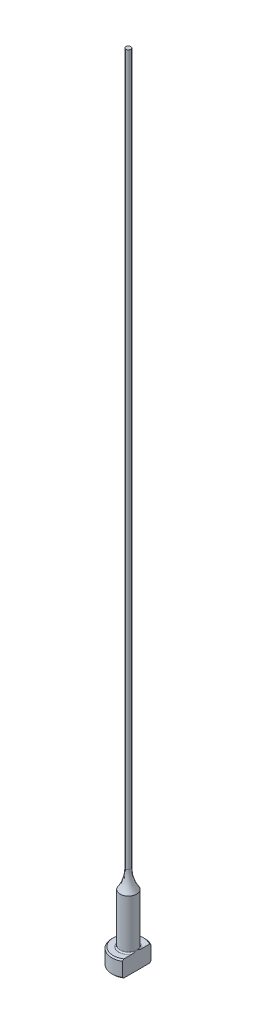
ISO-10303-21;
HEADER;
FILE_DESCRIPTION(('STEP AP214'),'2;1');
FILE_NAME('part.step','',(''),(''),'','','');
FILE_SCHEMA(('AUTOMOTIVE_DESIGN { 1 0 10303 214 1 1 1 1 }'));
ENDSEC;
DATA;
#1=APPLICATION_CONTEXT('core data for automotive mechanical design processes');
#2=APPLICATION_PROTOCOL_DEFINITION('international standard','automotive_design',2000,#1);
#3=PRODUCT_CONTEXT('',#1,'mechanical');
#4=PRODUCT('Part','Part','',(#3));
#5=PRODUCT_RELATED_PRODUCT_CATEGORY('part','',(#4));
#6=PRODUCT_DEFINITION_FORMATION('','',#4);
#7=PRODUCT_DEFINITION_CONTEXT('part definition',#1,'design');
#8=PRODUCT_DEFINITION('design','',#6,#7);
#9=PRODUCT_DEFINITION_SHAPE('','',#8);
#10=(LENGTH_UNIT() NAMED_UNIT(*) SI_UNIT(.MILLI.,.METRE.));
#11=(NAMED_UNIT(*) PLANE_ANGLE_UNIT() SI_UNIT($,.RADIAN.));
#12=(NAMED_UNIT(*) SI_UNIT($,.STERADIAN.) SOLID_ANGLE_UNIT());
#13=UNCERTAINTY_MEASURE_WITH_UNIT(LENGTH_MEASURE(1.E-05),#10,'distance_accuracy_value','');
#14=(GEOMETRIC_REPRESENTATION_CONTEXT(3) GLOBAL_UNCERTAINTY_ASSIGNED_CONTEXT((#13)) GLOBAL_UNIT_ASSIGNED_CONTEXT((#10,
#11,#12)) REPRESENTATION_CONTEXT('',''));
#15=CARTESIAN_POINT('',(0.,0.,0.));
#16=DIRECTION('',(0.,0.,1.));
#17=DIRECTION('',(1.,0.,0.));
#18=AXIS2_PLACEMENT_3D('',#15,#16,#17);
#19=CARTESIAN_POINT('',(-3.17499999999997,3.175,0.));
#20=DIRECTION('',(0.,1.,0.));
#21=DIRECTION('',(0.,0.,1.));
#22=AXIS2_PLACEMENT_3D('',#19,#20,#21);
#23=PLANE('',#22);
#24=CARTESIAN_POINT('',(0.,3.175,0.));
#25=DIRECTION('',(0.,1.,0.));
#26=DIRECTION('',(0.,0.,1.));
#27=AXIS2_PLACEMENT_3D('',#24,#25,#26);
#28=CIRCLE('',#27,2.92099999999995);
#29=CARTESIAN_POINT('',(1.58749999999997,3.175,-2.45195529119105));
#30=VERTEX_POINT('',#29);
#31=CARTESIAN_POINT('',(1.58749999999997,3.175,2.45195529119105));
#32=VERTEX_POINT('',#31);
#33=EDGE_CURVE('E105',#30,#32,#28,.T.);
#34=ORIENTED_EDGE('',*,*,#33,.T.);
#35=DIRECTION('',(0.,0.,1.));
#36=VECTOR('',#35,1.);
#37=CARTESIAN_POINT('',(1.58749999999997,3.17500000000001,2.74963065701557));
#38=LINE('',#37,#36);
#39=CARTESIAN_POINT('',(1.58749999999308,3.175,0.933255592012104));
#40=VERTEX_POINT('',#39);
#41=EDGE_CURVE('E126',#40,#32,#38,.T.);
#42=ORIENTED_EDGE('',*,*,#41,.F.);
#43=CARTESIAN_POINT('',(0.,3.175,0.));
#44=DIRECTION('',(0.,1.,0.));
#45=DIRECTION('',(0.,0.,1.));
#46=AXIS2_PLACEMENT_3D('',#43,#44,#45);
#47=CIRCLE('',#46,1.84149999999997);
#48=CARTESIAN_POINT('',(1.58749999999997,3.17500000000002,-0.933255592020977));
#49=VERTEX_POINT('',#48);
#50=EDGE_CURVE('E11',#40,#49,#47,.F.);
#51=ORIENTED_EDGE('',*,*,#50,.T.);
#52=EDGE_CURVE('E52',#30,#49,#38,.T.);
#53=ORIENTED_EDGE('',*,*,#52,.F.);
#54=EDGE_LOOP('',(#34,#42,#51,#53));
#55=FACE_BOUND('',#54,.T.);
#56=ADVANCED_FACE('F32',(#55),#23,.T.);
#57=CARTESIAN_POINT('',(0.,259.958771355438,0.));
#58=DIRECTION('',(0.,1.,0.));
#59=DIRECTION('',(0.,0.,1.));
#60=AXIS2_PLACEMENT_3D('',#57,#58,#59);
#61=CYLINDRICAL_SURFACE('',#60,3.17499999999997);
#62=CARTESIAN_POINT('',(0.,2.92100000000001,0.));
#63=DIRECTION('',(0.,1.,0.));
#64=DIRECTION('',(0.,0.,1.));
#65=AXIS2_PLACEMENT_3D('',#62,#63,#64);
#66=CIRCLE('',#65,3.17499999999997);
#67=CARTESIAN_POINT('',(1.58749999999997,2.92100000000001,2.74963065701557));
#68=VERTEX_POINT('',#67);
#69=CARTESIAN_POINT('',(1.58749999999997,2.92100000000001,-2.74963065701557));
#70=VERTEX_POINT('',#69);
#71=EDGE_CURVE('E98',#68,#70,#66,.F.);
#72=ORIENTED_EDGE('',*,*,#71,.T.);
#73=DIRECTION('',(0.,-1.,0.));
#74=VECTOR('',#73,1.);
#75=CARTESIAN_POINT('',(1.58749999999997,152.401,-2.74963065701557));
#76=LINE('',#75,#74);
#77=CARTESIAN_POINT('',(1.58749999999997,0.254000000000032,-2.74963065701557));
#78=VERTEX_POINT('',#77);
#79=EDGE_CURVE('E141',#70,#78,#76,.T.);
#80=ORIENTED_EDGE('',*,*,#79,.T.);
#81=CARTESIAN_POINT('',(0.,0.254000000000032,0.));
#82=DIRECTION('',(0.,-1.,0.));
#83=DIRECTION('',(0.,0.,-1.));
#84=AXIS2_PLACEMENT_3D('',#81,#82,#83);
#85=CIRCLE('',#84,3.17499999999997);
#86=CARTESIAN_POINT('',(1.58749999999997,0.254000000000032,2.74963065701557));
#87=VERTEX_POINT('',#86);
#88=EDGE_CURVE('E95',#78,#87,#85,.F.);
#89=ORIENTED_EDGE('',*,*,#88,.T.);
#90=DIRECTION('',(0.,-1.,0.));
#91=VECTOR('',#90,1.);
#92=CARTESIAN_POINT('',(1.58749999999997,152.401,2.74963065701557));
#93=LINE('',#92,#91);
#94=EDGE_CURVE('E88',#68,#87,#93,.T.);
#95=ORIENTED_EDGE('',*,*,#94,.F.);
#96=EDGE_LOOP('',(#72,#80,#89,#95));
#97=FACE_BOUND('',#96,.T.);
#98=ADVANCED_FACE('F191',(#97),#61,.T.);
#99=CARTESIAN_POINT('',(0.,0.,0.));
#100=DIRECTION('',(0.,-1.,0.));
#101=DIRECTION('',(0.,0.,-1.));
#102=AXIS2_PLACEMENT_3D('',#99,#100,#101);
#103=PLANE('',#102);
#104=CARTESIAN_POINT('',(0.,0.,0.));
#105=DIRECTION('',(0.,-1.,0.));
#106=DIRECTION('',(0.,0.,-1.));
#107=AXIS2_PLACEMENT_3D('',#104,#105,#106);
#108=CIRCLE('',#107,2.92099999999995);
#109=CARTESIAN_POINT('',(1.58749999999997,0.,2.45195529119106));
#110=VERTEX_POINT('',#109);
#111=CARTESIAN_POINT('',(1.58749999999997,0.,-2.45195529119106));
#112=VERTEX_POINT('',#111);
#113=EDGE_CURVE('E93',#110,#112,#108,.T.);
#114=ORIENTED_EDGE('',*,*,#113,.T.);
#115=DIRECTION('',(0.,0.,1.));
#116=VECTOR('',#115,1.);
#117=CARTESIAN_POINT('',(1.58749999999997,0.,2.74963065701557));
#118=LINE('',#117,#116);
#119=EDGE_CURVE('E78',#112,#110,#118,.T.);
#120=ORIENTED_EDGE('',*,*,#119,.T.);
#121=EDGE_LOOP('',(#114,#120));
#122=FACE_BOUND('',#121,.T.);
#123=ADVANCED_FACE('F97',(#122),#103,.T.);
#124=CARTESIAN_POINT('',(0.,3.17499999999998,0.));
#125=DIRECTION('',(0.,-1.,0.));
#126=DIRECTION('',(0.,0.,-1.));
#127=AXIS2_PLACEMENT_3D('',#124,#125,#126);
#128=CONICAL_SURFACE('',#127,2.92099999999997,0.7853981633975);
#129=ORIENTED_EDGE('',*,*,#71,.F.);
#130=CARTESIAN_POINT('',(1.58749999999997,-0.161620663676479,-6.0529050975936));
#131=CARTESIAN_POINT('',(1.58749999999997,-0.0288893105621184,-5.91567682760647));
#132=CARTESIAN_POINT('',(1.58749999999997,0.103699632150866,-5.77831035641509));
#133=CARTESIAN_POINT('',(1.58749999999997,0.36850839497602,-5.5032187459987));
#134=CARTESIAN_POINT('',(1.58749999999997,0.500728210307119,-5.36549360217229));
#135=CARTESIAN_POINT('',(1.58749999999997,0.764778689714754,-5.08953516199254));
#136=CARTESIAN_POINT('',(1.58749999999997,0.896609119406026,-4.95130164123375));
#137=CARTESIAN_POINT('',(1.58749999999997,1.15968706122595,-4.67428233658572));
#138=CARTESIAN_POINT('',(1.58749999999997,1.29093457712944,-4.53549655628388));
#139=CARTESIAN_POINT('',(1.58749999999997,1.55007705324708,-4.25997724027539));
#140=CARTESIAN_POINT('',(1.58749999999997,1.67798684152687,-4.12325766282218));
#141=CARTESIAN_POINT('',(1.58749999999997,1.93284861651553,-3.84892898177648));
#142=CARTESIAN_POINT('',(1.58749999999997,2.05980060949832,-3.71131988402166));
#143=CARTESIAN_POINT('',(1.58749999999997,2.31237508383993,-3.43493978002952));
#144=CARTESIAN_POINT('',(1.58749999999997,2.43799784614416,-3.29616903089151));
#145=CARTESIAN_POINT('',(1.58749999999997,2.68741369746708,-3.01699558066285));
#146=CARTESIAN_POINT('',(1.58749999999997,2.81120686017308,-2.87659294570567));
#147=CARTESIAN_POINT('',(1.58749999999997,3.0087586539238,-2.6481670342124));
#148=CARTESIAN_POINT('',(1.58749999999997,3.08336151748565,-2.56087478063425));
#149=CARTESIAN_POINT('',(1.58749999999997,3.23123871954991,-2.38515423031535));
#150=CARTESIAN_POINT('',(1.58749999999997,3.30451292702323,-2.29672582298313));
#151=CARTESIAN_POINT('',(1.58749999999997,3.45004422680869,-2.1174740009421));
#152=CARTESIAN_POINT('',(1.58749999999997,3.52228237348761,-2.02663514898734));
#153=CARTESIAN_POINT('',(1.58749999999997,3.6642309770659,-1.8430252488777));
#154=CARTESIAN_POINT('',(1.58749999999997,3.73394203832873,-1.75025467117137));
#155=CARTESIAN_POINT('',(1.58749999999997,3.87080633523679,-1.56067475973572));
#156=CARTESIAN_POINT('',(1.58749999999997,3.93790459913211,-1.46382547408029));
#157=CARTESIAN_POINT('',(1.58749999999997,4.06669147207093,-1.26632594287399));
#158=CARTESIAN_POINT('',(1.58749999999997,4.12837264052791,-1.16567073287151));
#159=CARTESIAN_POINT('',(1.58749999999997,4.2140225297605,-1.01165766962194));
#160=CARTESIAN_POINT('',(1.58749999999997,4.24127929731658,-0.960142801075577));
#161=CARTESIAN_POINT('',(1.58749999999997,4.29309798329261,-0.855780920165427));
#162=CARTESIAN_POINT('',(1.58749999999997,4.31765941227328,-0.802933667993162));
#163=CARTESIAN_POINT('',(1.58749999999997,4.38614656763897,-0.64246114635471));
#164=CARTESIAN_POINT('',(1.58749999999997,4.42510149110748,-0.532518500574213));
#165=CARTESIAN_POINT('',(1.58749999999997,4.46726244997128,-0.367680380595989));
#166=CARTESIAN_POINT('',(1.58749999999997,4.47844427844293,-0.314802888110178));
#167=CARTESIAN_POINT('',(1.58749999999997,4.495766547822,-0.2082097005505));
#168=CARTESIAN_POINT('',(1.58749999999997,4.50190743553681,-0.154494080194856));
#169=CARTESIAN_POINT('',(1.58749999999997,4.50871296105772,-0.0468792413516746));
#170=CARTESIAN_POINT('',(1.58749999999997,4.50939451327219,0.0070188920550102));
#171=CARTESIAN_POINT('',(1.58749999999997,4.50527679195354,0.114606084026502));
#172=CARTESIAN_POINT('',(1.58749999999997,4.50047706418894,0.168295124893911));
#173=CARTESIAN_POINT('',(1.58749999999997,4.48579689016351,0.274485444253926));
#174=CARTESIAN_POINT('',(1.58749999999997,4.47596081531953,0.326992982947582));
#175=CARTESIAN_POINT('',(1.58749999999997,4.45181809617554,0.430974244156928));
#176=CARTESIAN_POINT('',(1.58749999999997,4.43750969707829,0.48244755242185));
#177=CARTESIAN_POINT('',(1.58749999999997,4.40502489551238,0.584460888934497));
#178=CARTESIAN_POINT('',(1.58749999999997,4.38682724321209,0.634994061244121));
#179=CARTESIAN_POINT('',(1.58749999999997,4.34729308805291,0.734789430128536));
#180=CARTESIAN_POINT('',(1.58749999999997,4.32595722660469,0.784051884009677));
#181=CARTESIAN_POINT('',(1.58749999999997,4.25791922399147,0.930549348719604));
#182=CARTESIAN_POINT('',(1.58749999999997,4.20736047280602,1.02598802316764));
#183=CARTESIAN_POINT('',(1.58749999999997,4.09955451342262,1.2130431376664));
#184=CARTESIAN_POINT('',(1.58749999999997,4.04229912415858,1.30465471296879));
#185=CARTESIAN_POINT('',(1.58749999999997,3.9230874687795,1.4852621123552));
#186=CARTESIAN_POINT('',(1.58749999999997,3.86111349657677,1.57424615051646));
#187=CARTESIAN_POINT('',(1.58749999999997,3.73408621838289,1.74990003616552));
#188=CARTESIAN_POINT('',(1.58749999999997,3.66903444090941,1.8365709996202));
#189=CARTESIAN_POINT('',(1.58749999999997,3.53583371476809,2.00931764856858));
#190=CARTESIAN_POINT('',(1.58749999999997,3.46765527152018,2.09537048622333));
#191=CARTESIAN_POINT('',(1.58749999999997,3.32960643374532,2.26611736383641));
#192=CARTESIAN_POINT('',(1.58749999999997,3.25973586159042,2.35081125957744));
#193=CARTESIAN_POINT('',(1.58749999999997,3.04858139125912,2.60290121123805));
#194=CARTESIAN_POINT('',(1.58749999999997,2.90542388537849,2.76872537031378));
#195=CARTESIAN_POINT('',(1.58749999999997,2.64069522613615,3.06970913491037));
#196=CARTESIAN_POINT('',(1.58749999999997,2.5195945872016,3.20528660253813));
#197=CARTESIAN_POINT('',(1.58749999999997,2.275904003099,3.47510321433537));
#198=CARTESIAN_POINT('',(1.58749999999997,2.15331401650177,3.60934232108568));
#199=CARTESIAN_POINT('',(1.58749999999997,1.90694239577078,3.87695374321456));
#200=CARTESIAN_POINT('',(1.58749999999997,1.78315974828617,4.01032512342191));
#201=CARTESIAN_POINT('',(1.58749999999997,1.53478104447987,4.2763088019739));
#202=CARTESIAN_POINT('',(1.58749999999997,1.41018498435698,4.40892109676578));
#203=CARTESIAN_POINT('',(1.58749999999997,1.0457468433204,4.79499418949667));
#204=CARTESIAN_POINT('',(1.58749999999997,0.805076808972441,5.04767313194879));
#205=CARTESIAN_POINT('',(1.58749999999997,0.443121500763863,5.42550911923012));
#206=CARTESIAN_POINT('',(1.58749999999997,0.322378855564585,5.55118772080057));
#207=CARTESIAN_POINT('',(1.58749999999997,0.0805914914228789,5.80225207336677));
#208=CARTESIAN_POINT('',(1.58749999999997,-0.0404532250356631,5.92763782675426));
#209=CARTESIAN_POINT('',(1.58749999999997,-0.161620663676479,6.0529050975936));
#210=B_SPLINE_CURVE_WITH_KNOTS('',3,(#130,#131,#132,#133,#134,#135,#136,#137,#138,#139,#140,
#141,#142,#143,#144,#145,#146,#147,#148,#149,#150,#151,#152,#153,#154,#155,#156,#157,#158,#159,
#160,#161,#162,#163,#164,#165,#166,#167,#168,#169,#170,#171,#172,#173,#174,#175,#176,#177,#178,
#179,#180,#181,#182,#183,#184,#185,#186,#187,#188,#189,#190,#191,#192,#193,#194,#195,#196,#197,
#198,#199,#200,#201,#202,#203,#204,#205,#206,#207,#208,#209),.UNSPECIFIED.,.F.,.F.,(4,2,2,2,2,2,
2,2,2,2,2,2,2,2,2,2,2,2,2,2,2,2,2,2,2,2,2,2,2,2,2,2,2,2,2,2,2,2,2,4),(0.,0.572750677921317,
1.14550874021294,1.71856057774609,2.29160869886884,2.85328006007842,3.41494773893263,
3.97649423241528,4.53801804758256,4.88249307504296,5.22700189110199,5.57515326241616,
5.92322081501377,6.27657800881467,6.63041319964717,6.80518126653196,6.97998101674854,
7.32824262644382,7.49018491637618,7.65211285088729,7.813538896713,7.97497832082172,
8.13501929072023,8.29512313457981,8.4561251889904,8.61709438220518,8.94062993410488,
9.26456495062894,9.58978187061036,9.91483894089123,10.2441741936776,10.5735441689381,
11.2306812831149,11.7760337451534,12.3214014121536,12.8672825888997,13.4131663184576,
14.4600164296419,14.9828595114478,15.505698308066),.UNSPECIFIED.);
#211=EDGE_CURVE('E118',#32,#68,#210,.T.);
#212=ORIENTED_EDGE('',*,*,#211,.F.);
#213=ORIENTED_EDGE('',*,*,#33,.F.);
#214=EDGE_CURVE('E117',#70,#30,#210,.T.);
#215=ORIENTED_EDGE('',*,*,#214,.F.);
#216=EDGE_LOOP('',(#129,#212,#213,#215));
#217=FACE_BOUND('',#216,.T.);
#218=ADVANCED_FACE('F162',(#217),#128,.T.);
#219=CARTESIAN_POINT('',(0.,0.254000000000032,0.));
#220=DIRECTION('',(0.,1.,0.));
#221=DIRECTION('',(0.,0.,1.));
#222=AXIS2_PLACEMENT_3D('',#219,#220,#221);
#223=CONICAL_SURFACE('',#222,3.17499999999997,0.785398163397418);
#224=ORIENTED_EDGE('',*,*,#88,.F.);
#225=CARTESIAN_POINT('',(1.58749999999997,3.33662066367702,6.0529050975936));
#226=CARTESIAN_POINT('',(1.58749999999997,3.20388931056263,5.91567682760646));
#227=CARTESIAN_POINT('',(1.58749999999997,3.0713003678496,5.77831035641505));
#228=CARTESIAN_POINT('',(1.58749999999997,2.80649160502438,5.50321874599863));
#229=CARTESIAN_POINT('',(1.58749999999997,2.67427178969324,5.36549360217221));
#230=CARTESIAN_POINT('',(1.58749999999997,2.41022131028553,5.08953516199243));
#231=CARTESIAN_POINT('',(1.58749999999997,2.27839088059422,4.95130164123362));
#232=CARTESIAN_POINT('',(1.58749999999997,2.01531293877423,4.67428233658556));
#233=CARTESIAN_POINT('',(1.58749999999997,1.8840654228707,4.5354965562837));
#234=CARTESIAN_POINT('',(1.58749999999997,1.62492294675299,4.25997724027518));
#235=CARTESIAN_POINT('',(1.58749999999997,1.49701315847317,4.12325766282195));
#236=CARTESIAN_POINT('',(1.58749999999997,1.24215138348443,3.84892898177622));
#237=CARTESIAN_POINT('',(1.58749999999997,1.11519939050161,3.71131988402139));
#238=CARTESIAN_POINT('',(1.58749999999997,0.862624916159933,3.43493978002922));
#239=CARTESIAN_POINT('',(1.58749999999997,0.737002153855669,3.29616903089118));
#240=CARTESIAN_POINT('',(1.58749999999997,0.487586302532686,3.01699558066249));
#241=CARTESIAN_POINT('',(1.58749999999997,0.363793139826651,2.8765929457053));
#242=CARTESIAN_POINT('',(1.58749999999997,0.1662413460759,2.64816703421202));
#243=CARTESIAN_POINT('',(1.58749999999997,0.0916384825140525,2.56087478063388));
#244=CARTESIAN_POINT('',(1.58749999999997,-0.0562387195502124,2.385154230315));
#245=CARTESIAN_POINT('',(1.58749999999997,-0.129512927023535,2.29672582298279));
#246=CARTESIAN_POINT('',(1.58749999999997,-0.275044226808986,2.11747400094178));
#247=CARTESIAN_POINT('',(1.58749999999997,-0.34728237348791,2.02663514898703));
#248=CARTESIAN_POINT('',(1.58749999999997,-0.489230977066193,1.84302524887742));
#249=CARTESIAN_POINT('',(1.58749999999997,-0.558942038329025,1.75025467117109));
#250=CARTESIAN_POINT('',(1.58749999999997,-0.695806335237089,1.56067475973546));
#251=CARTESIAN_POINT('',(1.58749999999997,-0.762904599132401,1.46382547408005));
#252=CARTESIAN_POINT('',(1.58749999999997,-0.89169147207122,1.26632594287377));
#253=CARTESIAN_POINT('',(1.58749999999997,-0.953372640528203,1.16567073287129));
#254=CARTESIAN_POINT('',(1.58749999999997,-1.03902252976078,1.01165766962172));
#255=CARTESIAN_POINT('',(1.58749999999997,-1.06627929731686,0.960142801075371));
#256=CARTESIAN_POINT('',(1.58749999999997,-1.11809798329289,0.855780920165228));
#257=CARTESIAN_POINT('',(1.58749999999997,-1.14265941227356,0.802933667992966));
#258=CARTESIAN_POINT('',(1.58749999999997,-1.21114656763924,0.642461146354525));
#259=CARTESIAN_POINT('',(1.58749999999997,-1.25010149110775,0.532518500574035));
#260=CARTESIAN_POINT('',(1.58749999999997,-1.29226244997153,0.36768038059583));
#261=CARTESIAN_POINT('',(1.58749999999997,-1.30344427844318,0.31480288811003));
#262=CARTESIAN_POINT('',(1.58749999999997,-1.32076654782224,0.208209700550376));
#263=CARTESIAN_POINT('',(1.58749999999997,-1.32690743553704,0.154494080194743));
#264=CARTESIAN_POINT('',(1.58749999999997,-1.33371296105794,0.0468792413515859));
#265=CARTESIAN_POINT('',(1.58749999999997,-1.33439451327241,-0.0070188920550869));
#266=CARTESIAN_POINT('',(1.58749999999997,-1.33027679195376,-0.114606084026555));
#267=CARTESIAN_POINT('',(1.58749999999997,-1.32547706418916,-0.168295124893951));
#268=CARTESIAN_POINT('',(1.58749999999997,-1.31079689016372,-0.274485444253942));
#269=CARTESIAN_POINT('',(1.58749999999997,-1.30096081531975,-0.326992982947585));
#270=CARTESIAN_POINT('',(1.58749999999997,-1.27681809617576,-0.430974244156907));
#271=CARTESIAN_POINT('',(1.58749999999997,-1.26250969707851,-0.482447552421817));
#272=CARTESIAN_POINT('',(1.58749999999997,-1.2300248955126,-0.584460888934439));
#273=CARTESIAN_POINT('',(1.58749999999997,-1.21182724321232,-0.634994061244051));
#274=CARTESIAN_POINT('',(1.58749999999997,-1.17229308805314,-0.734789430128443));
#275=CARTESIAN_POINT('',(1.58749999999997,-1.15095722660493,-0.784051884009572));
#276=CARTESIAN_POINT('',(1.58749999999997,-1.08291922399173,-0.93054934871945));
#277=CARTESIAN_POINT('',(1.58749999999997,-1.0323604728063,-1.02598802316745));
#278=CARTESIAN_POINT('',(1.58749999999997,-0.92455451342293,-1.21304313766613));
#279=CARTESIAN_POINT('',(1.58749999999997,-0.867299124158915,-1.30465471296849));
#280=CARTESIAN_POINT('',(1.58749999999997,-0.748087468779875,-1.48526211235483));
#281=CARTESIAN_POINT('',(1.58749999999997,-0.686113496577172,-1.57424615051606));
#282=CARTESIAN_POINT('',(1.58749999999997,-0.559086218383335,-1.74990003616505));
#283=CARTESIAN_POINT('',(1.58749999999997,-0.494034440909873,-1.83657099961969));
#284=CARTESIAN_POINT('',(1.58749999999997,-0.360833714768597,-2.00931764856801));
#285=CARTESIAN_POINT('',(1.58749999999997,-0.292655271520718,-2.09537048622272));
#286=CARTESIAN_POINT('',(1.58749999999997,-0.154606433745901,-2.26611736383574));
#287=CARTESIAN_POINT('',(1.58749999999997,-0.084735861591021,-2.35081125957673));
#288=CARTESIAN_POINT('',(1.58749999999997,0.126418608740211,-2.60290121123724));
#289=CARTESIAN_POINT('',(1.58749999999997,0.26957611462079,-2.76872537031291));
#290=CARTESIAN_POINT('',(1.58749999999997,0.534304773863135,-3.06970913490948));
#291=CARTESIAN_POINT('',(1.58749999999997,0.655405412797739,-3.20528660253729));
#292=CARTESIAN_POINT('',(1.58749999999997,0.899095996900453,-3.47510321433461));
#293=CARTESIAN_POINT('',(1.58749999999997,1.02168598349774,-3.60934232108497));
#294=CARTESIAN_POINT('',(1.58749999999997,1.26805760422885,-3.87695374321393));
#295=CARTESIAN_POINT('',(1.58749999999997,1.39184025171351,-4.01032512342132));
#296=CARTESIAN_POINT('',(1.58749999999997,1.64021895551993,-4.2763088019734));
#297=CARTESIAN_POINT('',(1.58749999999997,1.76481501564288,-4.40892109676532));
#298=CARTESIAN_POINT('',(1.58749999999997,2.12925315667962,-4.79499418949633));
#299=CARTESIAN_POINT('',(1.58749999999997,2.36992319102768,-5.04767313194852));
#300=CARTESIAN_POINT('',(1.58749999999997,2.73187849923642,-5.42550911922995));
#301=CARTESIAN_POINT('',(1.58749999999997,2.85262114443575,-5.55118772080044));
#302=CARTESIAN_POINT('',(1.58749999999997,3.09440850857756,-5.8022520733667));
#303=CARTESIAN_POINT('',(1.58749999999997,3.21545322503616,-5.92763782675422));
#304=CARTESIAN_POINT('',(1.58749999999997,3.33662066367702,-6.0529050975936));
#305=B_SPLINE_CURVE_WITH_KNOTS('',3,(#225,#226,#227,#228,#229,#230,#231,#232,#233,#234,#235,
#236,#237,#238,#239,#240,#241,#242,#243,#244,#245,#246,#247,#248,#249,#250,#251,#252,#253,#254,
#255,#256,#257,#258,#259,#260,#261,#262,#263,#264,#265,#266,#267,#268,#269,#270,#271,#272,#273,
#274,#275,#276,#277,#278,#279,#280,#281,#282,#283,#284,#285,#286,#287,#288,#289,#290,#291,#292,
#293,#294,#295,#296,#297,#298,#299,#300,#301,#302,#303,#304),.UNSPECIFIED.,.F.,.F.,(4,2,2,2,2,2,
2,2,2,2,2,2,2,2,2,2,2,2,2,2,2,2,2,2,2,2,2,2,2,2,2,2,2,2,2,2,2,2,2,4),(0.,0.572750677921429,
1.14550874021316,1.71856057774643,2.29160869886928,2.85328006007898,3.41494773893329,
3.97649423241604,4.53801804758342,4.8824930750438,5.22700189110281,5.57515326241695,
5.92322081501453,6.27657800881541,6.63041319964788,6.80518126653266,6.97998101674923,
7.32824262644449,7.49018491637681,7.65211285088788,7.81353889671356,7.97497832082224,
8.13501929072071,8.29512313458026,8.45612518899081,8.61709438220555,8.94062993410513,
9.26456495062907,9.58978187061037,9.91483894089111,10.2441741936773,10.5735441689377,
11.2306812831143,11.776033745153,12.3214014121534,12.8672825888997,13.4131663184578,
14.4600164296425,14.9828595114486,15.505698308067),.UNSPECIFIED.);
#306=EDGE_CURVE('E81',#112,#78,#305,.T.);
#307=ORIENTED_EDGE('',*,*,#306,.F.);
#308=ORIENTED_EDGE('',*,*,#113,.F.);
#309=EDGE_CURVE('E84',#87,#110,#305,.T.);
#310=ORIENTED_EDGE('',*,*,#309,.F.);
#311=EDGE_LOOP('',(#224,#307,#308,#310));
#312=FACE_BOUND('',#311,.T.);
#313=ADVANCED_FACE('F92',(#312),#223,.T.);
#314=CARTESIAN_POINT('',(0.,3.42900000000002,0.));
#315=DIRECTION('',(0.,1.,0.));
#316=DIRECTION('',(0.,0.,1.));
#317=AXIS2_PLACEMENT_3D('',#314,#315,#316);
#318=TOROIDAL_SURFACE('',#317,1.84149999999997,0.254);
#319=CARTESIAN_POINT('',(1.58749999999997,3.42900000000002,0.));
#320=CARTESIAN_POINT('',(1.58749999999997,3.42899942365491,-1.9220514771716E-10));
#321=CARTESIAN_POINT('',(1.58749999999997,3.42899884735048,-1.2261161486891E-07));
#322=CARTESIAN_POINT('',(1.58749999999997,3.42899773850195,-5.09676365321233E-07));
#323=CARTESIAN_POINT('',(1.58749999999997,3.42899720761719,-7.78176328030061E-07));
#324=CARTESIAN_POINT('',(1.58749999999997,3.42899614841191,-1.42307272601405E-06));
#325=CARTESIAN_POINT('',(1.58749999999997,3.42899562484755,-1.80713867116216E-06));
#326=CARTESIAN_POINT('',(1.58749999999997,3.42899463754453,-2.63494846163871E-06));
#327=CARTESIAN_POINT('',(1.58749999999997,3.42899417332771,-3.07814756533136E-06));
#328=CARTESIAN_POINT('',(1.58749999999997,3.42899261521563,-4.66897357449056E-06));
#329=CARTESIAN_POINT('',(1.58749999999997,3.42899159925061,-5.89404908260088E-06));
#330=CARTESIAN_POINT('',(1.58749999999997,3.42898979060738,-8.42427511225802E-06));
#331=CARTESIAN_POINT('',(1.58749999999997,3.42898899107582,-9.7248057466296E-06));
#332=CARTESIAN_POINT('',(1.58749999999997,3.42898598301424,-1.48060601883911E-05));
#333=CARTESIAN_POINT('',(1.58749999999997,3.42898393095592,-1.86838281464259E-05));
#334=CARTESIAN_POINT('',(1.58749999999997,3.42898057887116,-2.63261117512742E-05));
#335=CARTESIAN_POINT('',(1.58749999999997,3.42897922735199,-3.00687417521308E-05));
#336=CARTESIAN_POINT('',(1.58749999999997,3.42897347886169,-4.60276298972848E-05));
#337=CARTESIAN_POINT('',(1.58749999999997,3.42896911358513,-5.8247019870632E-05));
#338=CARTESIAN_POINT('',(1.58749999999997,3.42896211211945,-8.11070097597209E-05));
#339=CARTESIAN_POINT('',(1.58749999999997,3.42895931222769,-9.16953114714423E-05));
#340=CARTESIAN_POINT('',(1.58749999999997,3.42893712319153,-0.000168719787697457));
#341=CARTESIAN_POINT('',(1.58749999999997,3.42890881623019,-0.000232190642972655));
#342=CARTESIAN_POINT('',(1.58749999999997,3.42880276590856,-0.000479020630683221));
#343=CARTESIAN_POINT('',(1.58749999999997,3.42873165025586,-0.00066443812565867));
#344=CARTESIAN_POINT('',(1.58749999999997,3.42845137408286,-0.0013844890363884));
#345=CARTESIAN_POINT('',(1.58749999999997,3.42823526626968,-0.00191701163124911));
#346=CARTESIAN_POINT('',(1.58749999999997,3.42735449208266,-0.00409774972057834));
#347=CARTESIAN_POINT('',(1.58749999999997,3.42669768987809,-0.00574830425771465));
#348=CARTESIAN_POINT('',(1.58749999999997,3.4174405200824,-0.0289985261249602));
#349=CARTESIAN_POINT('',(1.58749999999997,3.40878325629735,-0.0505816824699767));
#350=CARTESIAN_POINT('',(1.58749999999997,3.39189297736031,-0.0929947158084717));
#351=CARTESIAN_POINT('',(1.58749999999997,3.38365605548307,-0.11382315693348));
#352=CARTESIAN_POINT('',(1.58749999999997,3.36635393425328,-0.157956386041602));
#353=CARTESIAN_POINT('',(1.58749999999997,3.35730391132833,-0.181267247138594));
#354=CARTESIAN_POINT('',(1.58749999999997,3.33936775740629,-0.228222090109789));
#355=CARTESIAN_POINT('',(1.58749999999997,3.33048420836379,-0.25186705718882));
#356=CARTESIAN_POINT('',(1.58749999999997,3.30894496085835,-0.310512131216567));
#357=CARTESIAN_POINT('',(1.58749999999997,3.29649449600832,-0.345588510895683));
#358=CARTESIAN_POINT('',(1.58749999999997,3.27296975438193,-0.415278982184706));
#359=CARTESIAN_POINT('',(1.58749999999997,3.26186987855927,-0.449884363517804));
#360=CARTESIAN_POINT('',(1.58749999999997,3.2395832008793,-0.524471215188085));
#361=CARTESIAN_POINT('',(1.58749999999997,3.22860862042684,-0.564517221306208));
#362=CARTESIAN_POINT('',(1.58749999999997,3.20902534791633,-0.645529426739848));
#363=CARTESIAN_POINT('',(1.58749999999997,3.20043582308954,-0.686500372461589));
#364=CARTESIAN_POINT('',(1.58749999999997,3.18611712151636,-0.771546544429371));
#365=CARTESIAN_POINT('',(1.58749999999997,3.18059550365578,-0.815658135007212));
#366=CARTESIAN_POINT('',(1.58749999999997,3.17455396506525,-0.904117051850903));
#367=CARTESIAN_POINT('',(1.58749999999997,3.17401361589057,-0.948462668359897));
#368=CARTESIAN_POINT('',(1.58749999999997,3.17898948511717,-1.02531896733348));
#369=CARTESIAN_POINT('',(1.58749999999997,3.1829739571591,-1.05792141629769));
#370=CARTESIAN_POINT('',(1.58749999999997,3.19569167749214,-1.12184393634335));
#371=CARTESIAN_POINT('',(1.58749999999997,3.20436049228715,-1.1531753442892));
#372=CARTESIAN_POINT('',(1.58749999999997,3.22236152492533,-1.19946468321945));
#373=CARTESIAN_POINT('',(1.58749999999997,3.2295150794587,-1.21526783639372));
#374=CARTESIAN_POINT('',(1.58749999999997,3.24587062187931,-1.24583726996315));
#375=CARTESIAN_POINT('',(1.58749999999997,3.25507530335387,-1.26060215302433));
#376=CARTESIAN_POINT('',(1.58749999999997,3.27378481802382,-1.28575815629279));
#377=CARTESIAN_POINT('',(1.58749999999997,3.28289001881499,-1.29644383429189));
#378=CARTESIAN_POINT('',(1.58749999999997,3.30268460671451,-1.31623154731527));
#379=CARTESIAN_POINT('',(1.58749999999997,3.31337067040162,-1.32533681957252));
#380=CARTESIAN_POINT('',(1.58749999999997,3.33349977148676,-1.33941140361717));
#381=CARTESIAN_POINT('',(1.58749999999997,3.34261446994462,-1.34484814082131));
#382=CARTESIAN_POINT('',(1.58749999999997,3.36161455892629,-1.35416329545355));
#383=CARTESIAN_POINT('',(1.58749999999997,3.37149946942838,-1.35804267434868));
#384=CARTESIAN_POINT('',(1.58749999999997,3.39188678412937,-1.36398436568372));
#385=CARTESIAN_POINT('',(1.58749999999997,3.40239309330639,-1.36603350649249));
#386=CARTESIAN_POINT('',(1.58749999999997,3.42360372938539,-1.3680840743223));
#387=CARTESIAN_POINT('',(1.58749999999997,3.43430795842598,-1.36808648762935));
#388=CARTESIAN_POINT('',(1.58749999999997,3.45433283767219,-1.36616208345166));
#389=CARTESIAN_POINT('',(1.58749999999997,3.46367506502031,-1.36444960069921));
#390=CARTESIAN_POINT('',(1.58749999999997,3.48195519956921,-1.35953338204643));
#391=CARTESIAN_POINT('',(1.58749999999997,3.49089304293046,-1.3563294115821));
#392=CARTESIAN_POINT('',(1.58749999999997,3.50850302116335,-1.34848006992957));
#393=CARTESIAN_POINT('',(1.58749999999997,3.5171531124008,-1.34378578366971));
#394=CARTESIAN_POINT('',(1.58749999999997,3.53371257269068,-1.33324445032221));
#395=CARTESIAN_POINT('',(1.58749999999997,3.54162163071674,-1.32739692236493));
#396=CARTESIAN_POINT('',(1.58749999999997,3.56107121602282,-1.31107304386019));
#397=CARTESIAN_POINT('',(1.58749999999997,3.57202221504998,-1.29989286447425));
#398=CARTESIAN_POINT('',(1.58749999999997,3.59202509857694,-1.27593566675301));
#399=CARTESIAN_POINT('',(1.58749999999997,3.60107086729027,-1.26315370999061));
#400=CARTESIAN_POINT('',(1.58749999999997,3.62186023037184,-1.22930733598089));
#401=CARTESIAN_POINT('',(1.58749999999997,3.63240584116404,-1.20751096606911));
#402=CARTESIAN_POINT('',(1.58749999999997,3.65004643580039,-1.16266144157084));
#403=CARTESIAN_POINT('',(1.58749999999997,3.65714435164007,-1.13960937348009));
#404=CARTESIAN_POINT('',(1.58749999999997,3.67265428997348,-1.07603916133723));
#405=CARTESIAN_POINT('',(1.58749999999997,3.67834921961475,-1.03486686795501));
#406=CARTESIAN_POINT('',(1.58749999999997,3.68382880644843,-0.951558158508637));
#407=CARTESIAN_POINT('',(1.58749999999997,3.68350976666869,-0.909417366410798));
#408=CARTESIAN_POINT('',(1.58749999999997,3.67745397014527,-0.811383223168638));
#409=CARTESIAN_POINT('',(1.58749999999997,3.66993873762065,-0.755610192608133));
#410=CARTESIAN_POINT('',(1.58749999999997,3.64933373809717,-0.644937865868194));
#411=CARTESIAN_POINT('',(1.58749999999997,3.63621897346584,-0.59004364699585));
#412=CARTESIAN_POINT('',(1.58749999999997,3.60740922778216,-0.485757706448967));
#413=CARTESIAN_POINT('',(1.58749999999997,3.59201096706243,-0.436281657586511));
#414=CARTESIAN_POINT('',(1.58749999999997,3.55922497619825,-0.338551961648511));
#415=CARTESIAN_POINT('',(1.58749999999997,3.5418584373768,-0.290291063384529));
#416=CARTESIAN_POINT('',(1.58749999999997,3.51760237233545,-0.225557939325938));
#417=CARTESIAN_POINT('',(1.58749999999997,3.51126413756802,-0.208874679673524));
#418=CARTESIAN_POINT('',(1.58749999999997,3.49830042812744,-0.17512392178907));
#419=CARTESIAN_POINT('',(1.58749999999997,3.49167176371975,-0.158057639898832));
#420=CARTESIAN_POINT('',(1.58749999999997,3.47585523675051,-0.117638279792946));
#421=CARTESIAN_POINT('',(1.58749999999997,3.46662970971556,-0.0943002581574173));
#422=CARTESIAN_POINT('',(1.58749999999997,3.44889695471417,-0.0497824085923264));
#423=CARTESIAN_POINT('',(1.58749999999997,3.44040039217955,-0.028598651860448));
#424=CARTESIAN_POINT('',(1.58749999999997,3.43130364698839,-0.00575168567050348));
#425=CARTESIAN_POINT('',(1.58749999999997,3.43064818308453,-0.00410451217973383));
#426=CARTESIAN_POINT('',(1.58749999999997,3.42976776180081,-0.00192459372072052));
#427=CARTESIAN_POINT('',(1.58749999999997,3.42955062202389,-0.00138952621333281));
#428=CARTESIAN_POINT('',(1.58749999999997,3.42926908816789,-0.000666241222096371));
#429=CARTESIAN_POINT('',(1.58749999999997,3.42919771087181,-0.000480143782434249));
#430=CARTESIAN_POINT('',(1.58749999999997,3.42909131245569,-0.000232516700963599));
#431=CARTESIAN_POINT('',(1.58749999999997,3.42906294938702,-0.000168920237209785));
#432=CARTESIAN_POINT('',(1.58749999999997,3.42904072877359,-9.17527162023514E-05));
#433=CARTESIAN_POINT('',(1.58749999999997,3.42903792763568,-8.11550293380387E-05));
#434=CARTESIAN_POINT('',(1.58749999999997,3.42903091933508,-5.82743948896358E-05));
#435=CARTESIAN_POINT('',(1.58749999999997,3.42902654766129,-4.60440001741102E-05));
#436=CARTESIAN_POINT('',(1.58749999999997,3.42902079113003,-3.00727682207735E-05));
#437=CARTESIAN_POINT('',(1.58749999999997,3.42901943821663,-2.63286807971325E-05));
#438=CARTESIAN_POINT('',(1.58749999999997,3.42901608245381,-1.86836529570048E-05));
#439=CARTESIAN_POINT('',(1.58749999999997,3.4290140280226,-1.48046517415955E-05));
#440=CARTESIAN_POINT('',(1.58749999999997,3.42901101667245,-9.72223943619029E-06));
#441=CARTESIAN_POINT('',(1.58749999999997,3.42901021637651,-8.42159649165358E-06));
#442=CARTESIAN_POINT('',(1.58749999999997,3.42900840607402,-5.89129729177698E-06));
#443=CARTESIAN_POINT('',(1.58749999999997,3.42900738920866,-4.66626867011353E-06));
#444=CARTESIAN_POINT('',(1.58749999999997,3.42900582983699,-3.07568803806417E-06));
#445=CARTESIAN_POINT('',(1.58749999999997,3.42900536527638,-2.63259565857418E-06));
#446=CARTESIAN_POINT('',(1.58749999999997,3.4290043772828,-1.80506085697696E-06));
#447=CARTESIAN_POINT('',(1.58749999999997,3.42900385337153,-1.42116387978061E-06));
#448=CARTESIAN_POINT('',(1.58749999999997,3.42900279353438,-7.76675643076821E-07));
#449=CARTESIAN_POINT('',(1.58749999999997,3.42900226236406,-5.08406487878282E-07));
#450=CARTESIAN_POINT('',(1.58749999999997,3.42900115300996,-1.21901887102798E-07));
#451=CARTESIAN_POINT('',(1.58749999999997,3.42900057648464,1.92251677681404E-10));
#452=CARTESIAN_POINT('',(1.58749999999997,3.42900000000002,0.));
#453=B_SPLINE_CURVE_WITH_KNOTS('',3,(#319,#320,#321,#322,#323,#324,#325,#326,#327,#328,#329,
#330,#331,#332,#333,#334,#335,#336,#337,#338,#339,#340,#341,#342,#343,#344,#345,#346,#347,#348,
#349,#350,#351,#352,#353,#354,#355,#356,#357,#358,#359,#360,#361,#362,#363,#364,#365,#366,#367,
#368,#369,#370,#371,#372,#373,#374,#375,#376,#377,#378,#379,#380,#381,#382,#383,#384,#385,#386,
#387,#388,#389,#390,#391,#392,#393,#394,#395,#396,#397,#398,#399,#400,#401,#402,#403,#404,#405,
#406,#407,#408,#409,#410,#411,#412,#413,#414,#415,#416,#417,#418,#419,#420,#421,#422,#423,#424,
#425,#426,#427,#428,#429,#430,#431,#432,#433,#434,#435,#436,#437,#438,#439,#440,#441,#442,#443,
#444,#445,#446,#447,#448,#449,#450,#451,#452),.UNSPECIFIED.,.T.,.F.,(4,2,2,2,2,2,2,2,2,2,2,2,2,
2,2,2,2,2,2,2,2,2,2,2,2,2,2,2,2,2,2,2,2,2,2,2,2,2,2,2,2,2,2,2,2,2,2,2,2,2,2,2,2,2,2,2,2,2,2,2,2,
2,2,2,2,2,4),(0.,1.72815458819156E-06,3.50429255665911E-06,5.44431004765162E-06,
7.3675525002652E-06,1.2119089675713E-05,1.66953775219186E-05,2.98160400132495E-05,
4.17409564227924E-05,8.0660475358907E-05,0.000113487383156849,0.000321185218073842,
0.000917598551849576,0.00264089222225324,0.00797105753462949,0.0777276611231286,
0.144923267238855,0.219939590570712,0.295714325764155,0.407362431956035,0.516367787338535,
0.640878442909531,0.766362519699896,0.899536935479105,1.03216495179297,1.13045740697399,
1.22743103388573,1.27935899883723,1.33135556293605,1.37333248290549,1.41522237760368,
1.44693946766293,1.47863694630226,1.51056074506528,1.54246916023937,1.57083210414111,
1.59919951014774,1.62861579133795,1.65804436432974,1.70472658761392,1.75155645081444,
1.82378709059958,1.89595619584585,2.01995471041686,2.1460932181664,2.31447224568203,
2.48361094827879,2.6389891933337,2.79283011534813,2.84637031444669,2.9012946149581,
2.97658236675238,3.04504771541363,3.05036697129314,3.05209849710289,3.05269709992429,
3.05290520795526,3.05293806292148,3.05297701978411,3.05298895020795,3.05300207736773,
3.05300665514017,3.0530114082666,3.05301333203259,3.05301527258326,3.05301704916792,
3.05301877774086),.UNSPECIFIED.);
#454=CARTESIAN_POINT('',(1.58749999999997,3.42900000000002,0.));
#455=VERTEX_POINT('',#454);
#456=EDGE_CURVE('E47',#455,#49,#453,.T.);
#457=ORIENTED_EDGE('',*,*,#456,.T.);
#458=ORIENTED_EDGE('',*,*,#50,.F.);
#459=CARTESIAN_POINT('',(1.58749999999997,3.42900000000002,0.));
#460=CARTESIAN_POINT('',(1.58749999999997,3.42900057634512,1.9220512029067E-10));
#461=CARTESIAN_POINT('',(1.58749999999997,3.42900115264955,1.22611614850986E-07));
#462=CARTESIAN_POINT('',(1.58749999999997,3.42900226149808,5.09676365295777E-07));
#463=CARTESIAN_POINT('',(1.58749999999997,3.42900279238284,7.78176328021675E-07));
#464=CARTESIAN_POINT('',(1.58749999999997,3.42900385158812,1.42307272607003E-06));
#465=CARTESIAN_POINT('',(1.58749999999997,3.42900437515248,1.80713867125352E-06));
#466=CARTESIAN_POINT('',(1.58749999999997,3.4290053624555,2.63494846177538E-06));
#467=CARTESIAN_POINT('',(1.58749999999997,3.42900582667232,3.0781475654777E-06));
#468=CARTESIAN_POINT('',(1.58749999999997,3.4290073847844,4.66897357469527E-06));
#469=CARTESIAN_POINT('',(1.58749999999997,3.42900840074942,5.89404908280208E-06));
#470=CARTESIAN_POINT('',(1.58749999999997,3.42901020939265,8.42427511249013E-06));
#471=CARTESIAN_POINT('',(1.58749999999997,3.42901100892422,9.72480574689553E-06));
#472=CARTESIAN_POINT('',(1.58749999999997,3.42901401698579,1.48060601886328E-05));
#473=CARTESIAN_POINT('',(1.58749999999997,3.42901606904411,1.86838281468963E-05));
#474=CARTESIAN_POINT('',(1.58749999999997,3.42901942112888,2.63261117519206E-05));
#475=CARTESIAN_POINT('',(1.58749999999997,3.42902077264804,3.00687417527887E-05));
#476=CARTESIAN_POINT('',(1.58749999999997,3.42902652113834,4.60276298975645E-05));
#477=CARTESIAN_POINT('',(1.58749999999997,3.4290308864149,5.82470198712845E-05));
#478=CARTESIAN_POINT('',(1.58749999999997,3.42903788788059,8.11070097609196E-05));
#479=CARTESIAN_POINT('',(1.58749999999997,3.42904068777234,9.16953114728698E-05));
#480=CARTESIAN_POINT('',(1.58749999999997,3.4290628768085,0.000168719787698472));
#481=CARTESIAN_POINT('',(1.58749999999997,3.42909118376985,0.000232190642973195));
#482=CARTESIAN_POINT('',(1.58749999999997,3.42919723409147,0.000479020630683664));
#483=CARTESIAN_POINT('',(1.58749999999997,3.42926834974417,0.000664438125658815));
#484=CARTESIAN_POINT('',(1.58749999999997,3.42954862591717,0.00138448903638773));
#485=CARTESIAN_POINT('',(1.58749999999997,3.42976473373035,0.00191701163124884));
#486=CARTESIAN_POINT('',(1.58749999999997,3.43064550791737,0.00409774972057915));
#487=CARTESIAN_POINT('',(1.58749999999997,3.43130231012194,0.00574830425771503));
#488=CARTESIAN_POINT('',(1.58749999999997,3.44055947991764,0.0289985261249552));
#489=CARTESIAN_POINT('',(1.58749999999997,3.44921674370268,0.0505816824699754));
#490=CARTESIAN_POINT('',(1.58749999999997,3.46610702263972,0.0929947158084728));
#491=CARTESIAN_POINT('',(1.58749999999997,3.47434394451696,0.11382315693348));
#492=CARTESIAN_POINT('',(1.58749999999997,3.49164606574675,0.157956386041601));
#493=CARTESIAN_POINT('',(1.58749999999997,3.5006960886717,0.181267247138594));
#494=CARTESIAN_POINT('',(1.58749999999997,3.51863224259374,0.228222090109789));
#495=CARTESIAN_POINT('',(1.58749999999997,3.52751579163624,0.25186705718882));
#496=CARTESIAN_POINT('',(1.58749999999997,3.54905503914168,0.310512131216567));
#497=CARTESIAN_POINT('',(1.58749999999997,3.56150550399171,0.345588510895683));
#498=CARTESIAN_POINT('',(1.58749999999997,3.5850302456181,0.415278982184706));
#499=CARTESIAN_POINT('',(1.58749999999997,3.59613012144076,0.449884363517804));
#500=CARTESIAN_POINT('',(1.58749999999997,3.61841679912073,0.524471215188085));
#501=CARTESIAN_POINT('',(1.58749999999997,3.62939137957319,0.564517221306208));
#502=CARTESIAN_POINT('',(1.58749999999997,3.6489746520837,0.645529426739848));
#503=CARTESIAN_POINT('',(1.58749999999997,3.65756417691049,0.686500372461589));
#504=CARTESIAN_POINT('',(1.58749999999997,3.67188287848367,0.771546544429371));
#505=CARTESIAN_POINT('',(1.58749999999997,3.67740449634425,0.815658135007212));
#506=CARTESIAN_POINT('',(1.58749999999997,3.68344603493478,0.904117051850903));
#507=CARTESIAN_POINT('',(1.58749999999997,3.68398638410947,0.948462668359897));
#508=CARTESIAN_POINT('',(1.58749999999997,3.67901051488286,1.02531896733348));
#509=CARTESIAN_POINT('',(1.58749999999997,3.67502604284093,1.05792141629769));
#510=CARTESIAN_POINT('',(1.58749999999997,3.66230832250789,1.12184393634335));
#511=CARTESIAN_POINT('',(1.58749999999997,3.65363950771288,1.1531753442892));
#512=CARTESIAN_POINT('',(1.58749999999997,3.6356384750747,1.19946468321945));
#513=CARTESIAN_POINT('',(1.58749999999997,3.62848492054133,1.21526783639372));
#514=CARTESIAN_POINT('',(1.58749999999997,3.61212937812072,1.24583726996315));
#515=CARTESIAN_POINT('',(1.58749999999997,3.60292469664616,1.26060215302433));
#516=CARTESIAN_POINT('',(1.58749999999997,3.58421518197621,1.28575815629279));
#517=CARTESIAN_POINT('',(1.58749999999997,3.57510998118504,1.29644383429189));
#518=CARTESIAN_POINT('',(1.58749999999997,3.55531539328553,1.31623154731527));
#519=CARTESIAN_POINT('',(1.58749999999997,3.54462932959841,1.32533681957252));
#520=CARTESIAN_POINT('',(1.58749999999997,3.52450022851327,1.33941140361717));
#521=CARTESIAN_POINT('',(1.58749999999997,3.51538553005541,1.34484814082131));
#522=CARTESIAN_POINT('',(1.58749999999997,3.49638544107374,1.35416329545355));
#523=CARTESIAN_POINT('',(1.58749999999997,3.48650053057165,1.35804267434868));
#524=CARTESIAN_POINT('',(1.58749999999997,3.46611321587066,1.36398436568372));
#525=CARTESIAN_POINT('',(1.58749999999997,3.45560690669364,1.36603350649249));
#526=CARTESIAN_POINT('',(1.58749999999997,3.43439627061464,1.3680840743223));
#527=CARTESIAN_POINT('',(1.58749999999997,3.42369204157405,1.36808648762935));
#528=CARTESIAN_POINT('',(1.58749999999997,3.40366716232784,1.36616208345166));
#529=CARTESIAN_POINT('',(1.58749999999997,3.39432493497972,1.36444960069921));
#530=CARTESIAN_POINT('',(1.58749999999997,3.37604480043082,1.35953338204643));
#531=CARTESIAN_POINT('',(1.58749999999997,3.36710695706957,1.3563294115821));
#532=CARTESIAN_POINT('',(1.58749999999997,3.34949697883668,1.34848006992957));
#533=CARTESIAN_POINT('',(1.58749999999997,3.34084688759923,1.34378578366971));
#534=CARTESIAN_POINT('',(1.58749999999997,3.32428742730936,1.33324445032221));
#535=CARTESIAN_POINT('',(1.58749999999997,3.31637836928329,1.32739692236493));
#536=CARTESIAN_POINT('',(1.58749999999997,3.29692878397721,1.31107304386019));
#537=CARTESIAN_POINT('',(1.58749999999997,3.28597778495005,1.29989286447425));
#538=CARTESIAN_POINT('',(1.58749999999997,3.26597490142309,1.27593566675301));
#539=CARTESIAN_POINT('',(1.58749999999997,3.25692913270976,1.26315370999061));
#540=CARTESIAN_POINT('',(1.58749999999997,3.23613976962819,1.22930733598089));
#541=CARTESIAN_POINT('',(1.58749999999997,3.22559415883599,1.20751096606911));
#542=CARTESIAN_POINT('',(1.58749999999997,3.20795356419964,1.16266144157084));
#543=CARTESIAN_POINT('',(1.58749999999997,3.20085564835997,1.13960937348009));
#544=CARTESIAN_POINT('',(1.58749999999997,3.18534571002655,1.07603916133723));
#545=CARTESIAN_POINT('',(1.58749999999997,3.17965078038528,1.03486686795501));
#546=CARTESIAN_POINT('',(1.58749999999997,3.1741711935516,0.951558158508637));
#547=CARTESIAN_POINT('',(1.58749999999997,3.17449023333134,0.909417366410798));
#548=CARTESIAN_POINT('',(1.58749999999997,3.18054602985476,0.811383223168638));
#549=CARTESIAN_POINT('',(1.58749999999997,3.18806126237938,0.755610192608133));
#550=CARTESIAN_POINT('',(1.58749999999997,3.20866626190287,0.644937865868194));
#551=CARTESIAN_POINT('',(1.58749999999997,3.2217810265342,0.59004364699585));
#552=CARTESIAN_POINT('',(1.58749999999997,3.25059077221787,0.485757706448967));
#553=CARTESIAN_POINT('',(1.58749999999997,3.2659890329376,0.43628165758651));
#554=CARTESIAN_POINT('',(1.58749999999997,3.29877502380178,0.338551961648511));
#555=CARTESIAN_POINT('',(1.58749999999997,3.31614156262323,0.290291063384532));
#556=CARTESIAN_POINT('',(1.58749999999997,3.34039762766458,0.225557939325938));
#557=CARTESIAN_POINT('',(1.58749999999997,3.346735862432,0.208874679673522));
#558=CARTESIAN_POINT('',(1.58749999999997,3.35969957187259,0.175123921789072));
#559=CARTESIAN_POINT('',(1.58749999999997,3.3663282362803,0.15805763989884));
#560=CARTESIAN_POINT('',(1.58749999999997,3.3821447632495,0.117638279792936));
#561=CARTESIAN_POINT('',(1.58749999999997,3.39137029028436,0.0943002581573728));
#562=CARTESIAN_POINT('',(1.58749999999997,3.40910304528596,0.0497824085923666));
#563=CARTESIAN_POINT('',(1.58749999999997,3.41759960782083,0.0285986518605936));
#564=CARTESIAN_POINT('',(1.58749999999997,3.42669635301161,0.00575168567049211));
#565=CARTESIAN_POINT('',(1.58749999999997,3.42735181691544,0.00410451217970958));
#566=CARTESIAN_POINT('',(1.58749999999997,3.42823223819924,0.00192459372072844));
#567=CARTESIAN_POINT('',(1.58749999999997,3.42844937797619,0.00138952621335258));
#568=CARTESIAN_POINT('',(1.58749999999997,3.42873091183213,0.000666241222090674));
#569=CARTESIAN_POINT('',(1.58749999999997,3.42880228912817,0.000480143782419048));
#570=CARTESIAN_POINT('',(1.58749999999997,3.42890868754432,0.000232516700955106));
#571=CARTESIAN_POINT('',(1.58749999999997,3.42893705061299,0.000168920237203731));
#572=CARTESIAN_POINT('',(1.58749999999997,3.42895927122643,9.17527161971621E-05));
#573=CARTESIAN_POINT('',(1.58749999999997,3.42896207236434,8.1155029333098E-05));
#574=CARTESIAN_POINT('',(1.58749999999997,3.42896908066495,5.82743948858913E-05));
#575=CARTESIAN_POINT('',(1.58749999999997,3.42897345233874,4.60440001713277E-05));
#576=CARTESIAN_POINT('',(1.58749999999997,3.42897920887,3.00727682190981E-05));
#577=CARTESIAN_POINT('',(1.58749999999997,3.42898056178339,2.63286807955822E-05));
#578=CARTESIAN_POINT('',(1.58749999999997,3.42898391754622,1.86836529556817E-05));
#579=CARTESIAN_POINT('',(1.58749999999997,3.42898597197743,1.48046517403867E-05));
#580=CARTESIAN_POINT('',(1.58749999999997,3.42898898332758,9.72223943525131E-06));
#581=CARTESIAN_POINT('',(1.58749999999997,3.42898978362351,8.42159649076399E-06));
#582=CARTESIAN_POINT('',(1.58749999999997,3.42899159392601,5.89129729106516E-06));
#583=CARTESIAN_POINT('',(1.58749999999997,3.42899261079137,4.66626866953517E-06));
#584=CARTESIAN_POINT('',(1.58749999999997,3.42899417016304,3.0756880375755E-06));
#585=CARTESIAN_POINT('',(1.58749999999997,3.42899463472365,2.63259565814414E-06));
#586=CARTESIAN_POINT('',(1.58749999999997,3.42899562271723,1.80506085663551E-06));
#587=CARTESIAN_POINT('',(1.58749999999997,3.42899614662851,1.42116387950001E-06));
#588=CARTESIAN_POINT('',(1.58749999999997,3.42899720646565,7.7667564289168E-07));
#589=CARTESIAN_POINT('',(1.58749999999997,3.42899773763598,5.0840648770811E-07));
#590=CARTESIAN_POINT('',(1.58749999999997,3.42899884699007,1.21901887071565E-07));
#591=CARTESIAN_POINT('',(1.58749999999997,3.42899942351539,-1.92251650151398E-10));
#592=CARTESIAN_POINT('',(1.58749999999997,3.42900000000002,0.));
#593=B_SPLINE_CURVE_WITH_KNOTS('',3,(#459,#460,#461,#462,#463,#464,#465,#466,#467,#468,#469,
#470,#471,#472,#473,#474,#475,#476,#477,#478,#479,#480,#481,#482,#483,#484,#485,#486,#487,#488,
#489,#490,#491,#492,#493,#494,#495,#496,#497,#498,#499,#500,#501,#502,#503,#504,#505,#506,#507,
#508,#509,#510,#511,#512,#513,#514,#515,#516,#517,#518,#519,#520,#521,#522,#523,#524,#525,#526,
#527,#528,#529,#530,#531,#532,#533,#534,#535,#536,#537,#538,#539,#540,#541,#542,#543,#544,#545,
#546,#547,#548,#549,#550,#551,#552,#553,#554,#555,#556,#557,#558,#559,#560,#561,#562,#563,#564,
#565,#566,#567,#568,#569,#570,#571,#572,#573,#574,#575,#576,#577,#578,#579,#580,#581,#582,#583,
#584,#585,#586,#587,#588,#589,#590,#591,#592),.UNSPECIFIED.,.T.,.F.,(4,2,2,2,2,2,2,2,2,2,2,2,2,
2,2,2,2,2,2,2,2,2,2,2,2,2,2,2,2,2,2,2,2,2,2,2,2,2,2,2,2,2,2,2,2,2,2,2,2,2,2,2,2,2,2,2,2,2,2,2,2,
2,2,2,2,2,4),(0.,1.72815458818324E-06,3.50429255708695E-06,5.44431004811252E-06,
7.36755250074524E-06,1.21190896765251E-05,1.66953775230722E-05,2.98160400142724E-05,
4.17409564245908E-05,8.06604753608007E-05,0.000113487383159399,0.000321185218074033,
0.000917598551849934,0.00264089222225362,0.00797105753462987,0.077727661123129,
0.144923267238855,0.219939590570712,0.295714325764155,0.407362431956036,0.516367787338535,
0.640878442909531,0.766362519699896,0.899536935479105,1.03216495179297,1.13045740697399,
1.22743103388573,1.27935899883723,1.33135556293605,1.37333248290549,1.41522237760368,
1.44693946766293,1.47863694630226,1.51056074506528,1.54246916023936,1.57083210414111,
1.59919951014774,1.62861579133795,1.65804436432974,1.70472658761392,1.75155645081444,
1.82378709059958,1.89595619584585,2.01995471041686,2.1460932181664,2.31447224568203,
2.48361094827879,2.6389891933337,2.79283011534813,2.84637031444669,2.9012946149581,
2.97658236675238,3.04504771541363,3.05036697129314,3.05209849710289,3.05269709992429,
3.05290520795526,3.05293806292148,3.05297701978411,3.05298895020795,3.05300207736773,
3.05300665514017,3.0530114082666,3.05301333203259,3.05301527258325,3.05301704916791,
3.05301877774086),.UNSPECIFIED.);
#594=EDGE_CURVE('E147',#40,#455,#593,.T.);
#595=ORIENTED_EDGE('',*,*,#594,.T.);
#596=CARTESIAN_POINT('',(0.,3.42900000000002,0.));
#597=DIRECTION('',(0.,1.,0.));
#598=DIRECTION('',(0.,0.,1.));
#599=AXIS2_PLACEMENT_3D('',#596,#597,#598);
#600=CIRCLE('',#599,1.58749999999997);
#601=EDGE_CURVE('E40',#455,#455,#600,.T.);
#602=ORIENTED_EDGE('',*,*,#601,.F.);
#603=EDGE_LOOP('',(#457,#458,#595,#602));
#604=FACE_BOUND('',#603,.T.);
#605=ADVANCED_FACE('F34',(#604),#318,.F.);
#606=CARTESIAN_POINT('',(-0.459739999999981,152.4,0.));
#607=DIRECTION('',(0.,1.,0.));
#608=DIRECTION('',(0.,0.,1.));
#609=AXIS2_PLACEMENT_3D('',#606,#607,#608);
#610=PLANE('',#609);
#611=CARTESIAN_POINT('',(0.,152.4,0.));
#612=DIRECTION('',(0.,1.,0.));
#613=DIRECTION('',(0.,0.,1.));
#614=AXIS2_PLACEMENT_3D('',#611,#612,#613);
#615=CIRCLE('',#614,0.459739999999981);
#616=CARTESIAN_POINT('',(0.,152.4,0.459739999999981));
#617=VERTEX_POINT('',#616);
#618=EDGE_CURVE('E108',#617,#617,#615,.T.);
#619=ORIENTED_EDGE('',*,*,#618,.T.);
#620=EDGE_LOOP('',(#619));
#621=FACE_BOUND('',#620,.T.);
#622=ADVANCED_FACE('F180',(#621),#610,.T.);
#623=CARTESIAN_POINT('',(0.,259.958771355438,0.));
#624=DIRECTION('',(0.,1.,0.));
#625=DIRECTION('',(0.,0.,1.));
#626=AXIS2_PLACEMENT_3D('',#623,#624,#625);
#627=CYLINDRICAL_SURFACE('',#626,0.459739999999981);
#628=CARTESIAN_POINT('',(0.,16.3125765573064,0.));
#629=DIRECTION('',(0.,1.,0.));
#630=DIRECTION('',(0.,0.,1.));
#631=AXIS2_PLACEMENT_3D('',#628,#629,#630);
#632=CIRCLE('',#631,0.459739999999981);
#633=CARTESIAN_POINT('',(0.,16.3125765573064,0.459739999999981));
#634=VERTEX_POINT('',#633);
#635=EDGE_CURVE('E111',#634,#634,#632,.T.);
#636=ORIENTED_EDGE('',*,*,#635,.T.);
#637=EDGE_LOOP('',(#636));
#638=FACE_BOUND('',#637,.T.);
#639=ORIENTED_EDGE('',*,*,#618,.F.);
#640=EDGE_LOOP('',(#639));
#641=FACE_BOUND('',#640,.T.);
#642=ADVANCED_FACE('F174',(#638,#641),#627,.T.);
#643=CARTESIAN_POINT('',(0.,16.3125765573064,0.));
#644=DIRECTION('',(0.,1.,0.));
#645=DIRECTION('',(0.,0.,1.));
#646=AXIS2_PLACEMENT_3D('',#643,#644,#645);
#647=TOROIDAL_SURFACE('',#646,6.80973999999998,6.35);
#648=CARTESIAN_POINT('',(0.,12.7,0.));
#649=DIRECTION('',(0.,1.,0.));
#650=DIRECTION('',(0.,0.,1.));
#651=AXIS2_PLACEMENT_3D('',#648,#649,#650);
#652=CIRCLE('',#651,1.58749999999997);
#653=CARTESIAN_POINT('',(0.,12.7,1.58749999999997));
#654=VERTEX_POINT('',#653);
#655=EDGE_CURVE('E114',#654,#654,#652,.T.);
#656=ORIENTED_EDGE('',*,*,#655,.T.);
#657=EDGE_LOOP('',(#656));
#658=FACE_BOUND('',#657,.T.);
#659=ORIENTED_EDGE('',*,*,#635,.F.);
#660=EDGE_LOOP('',(#659));
#661=FACE_BOUND('',#660,.T.);
#662=ADVANCED_FACE('F168',(#658,#661),#647,.F.);
#663=CARTESIAN_POINT('',(0.,259.958771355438,0.));
#664=DIRECTION('',(0.,1.,0.));
#665=DIRECTION('',(0.,0.,1.));
#666=AXIS2_PLACEMENT_3D('',#663,#664,#665);
#667=CYLINDRICAL_SURFACE('',#666,1.58749999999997);
#668=ORIENTED_EDGE('',*,*,#601,.T.);
#669=EDGE_LOOP('',(#668));
#670=FACE_BOUND('',#669,.T.);
#671=ORIENTED_EDGE('',*,*,#655,.F.);
#672=EDGE_LOOP('',(#671));
#673=FACE_BOUND('',#672,.T.);
#674=ADVANCED_FACE('F165',(#670,#673),#667,.T.);
#675=CARTESIAN_POINT('',(1.58749999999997,152.401,2.74963065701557));
#676=DIRECTION('',(1.,0.,0.));
#677=DIRECTION('',(0.,0.,-1.));
#678=AXIS2_PLACEMENT_3D('',#675,#676,#677);
#679=PLANE('',#678);
#680=ORIENTED_EDGE('',*,*,#309,.T.);
#681=ORIENTED_EDGE('',*,*,#119,.F.);
#682=ORIENTED_EDGE('',*,*,#306,.T.);
#683=ORIENTED_EDGE('',*,*,#79,.F.);
#684=ORIENTED_EDGE('',*,*,#214,.T.);
#685=ORIENTED_EDGE('',*,*,#52,.T.);
#686=ORIENTED_EDGE('',*,*,#456,.F.);
#687=ORIENTED_EDGE('',*,*,#594,.F.);
#688=ORIENTED_EDGE('',*,*,#41,.T.);
#689=ORIENTED_EDGE('',*,*,#211,.T.);
#690=ORIENTED_EDGE('',*,*,#94,.T.);
#691=EDGE_LOOP('',(#680,#681,#682,#683,#684,#685,#686,#687,#688,#689,#690));
#692=FACE_BOUND('',#691,.T.);
#693=ADVANCED_FACE('F80',(#692),#679,.T.);
#694=CLOSED_SHELL('',(#56,#98,#123,#218,#313,#605,#622,#642,#662,#674,#693));
#695=MANIFOLD_SOLID_BREP('B2',#694);
#696=ADVANCED_BREP_SHAPE_REPRESENTATION('',(#18,#695),#14);
#697=SHAPE_DEFINITION_REPRESENTATION(#9,#696);
ENDSEC;
END-ISO-10303-21;
